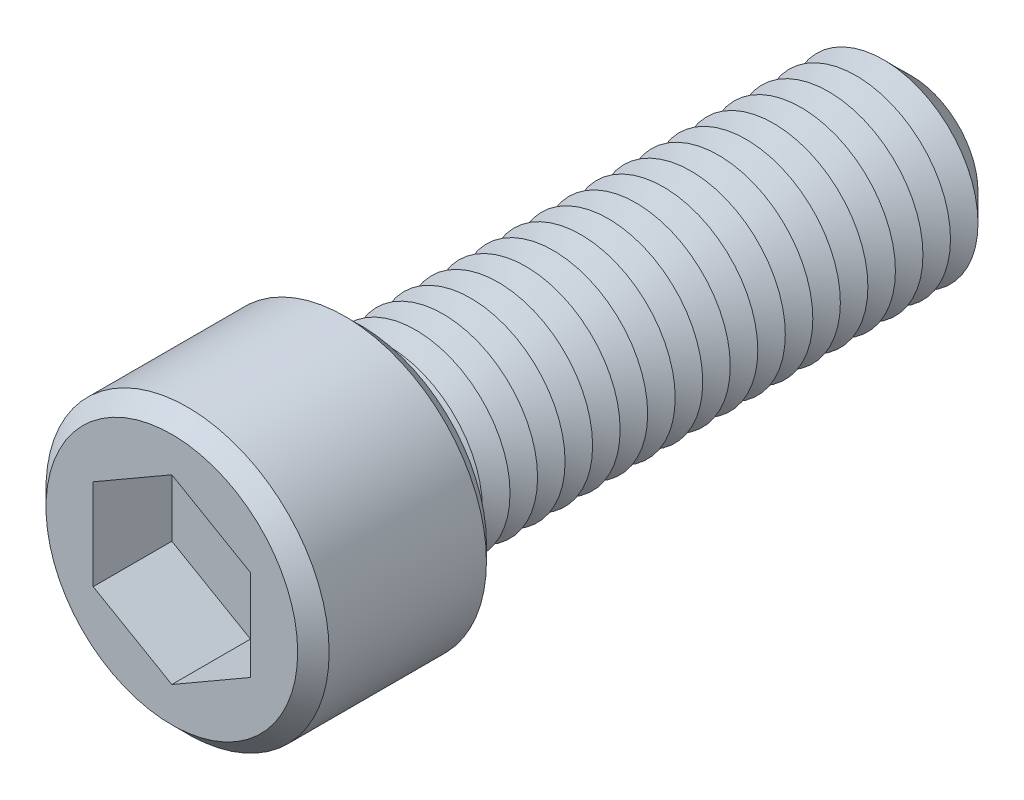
from build123d import *

# Parameters (mm, degrees)
SKETCH1_R           = 9
BOSS_EXTRUDE1_DEPTH = 12
SKETCH2_R           = 6
BOSS_EXTRUDE2_DEPTH = 35
CHAMFER1_SIZE       = 1.75
LPATTERN1_COUNT     = 19
LPATTERN1_PITCH     = 1.75
CUT_EXTRUDE1_DEPTH  = 5
SKETCH6_R           = 0.9
CUT_EXTRUDE2_DEPTH  = 42
CHAMFER2_SIZE       = 1


with BuildPart() as part:
    # Sketch1 → Boss-Extrude1 (new body)
    with BuildSketch(Plane.XY):
        Circle(SKETCH1_R)
    extrude(amount=BOSS_EXTRUDE1_DEPTH)

    # Sketch2 → Boss-Extrude2 (add)
    with BuildSketch(Plane(origin=(0, 0, 0), x_dir=(-1, 0, 0), z_dir=(0, 0, -1))):
        Circle(SKETCH2_R)
    extrude(amount=BOSS_EXTRUDE2_DEPTH)

    # Chamfer1
    chamfer1_edges = [part.edges().sort_by_distance(p)[0] for p in [
        (6, 0, -35),
    ]]
    chamfer(chamfer1_edges, length=CHAMFER1_SIZE)

    # Sketch4 → Cut-Revolve1 (revolve, cut)
    with BuildSketch(Plane(origin=(0, 0, 0), x_dir=(0, 0, -1), z_dir=(1, 0, 0)), mode=Mode.PRIVATE) as cut_revolve1_sk:
        Polygon((0, 6), (0.875, 4.484455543), (1.75, 6), align=None)
    cut_revolve1 = revolve(cut_revolve1_sk.sketch.rotate(Axis((0, 0, 2.512122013), (0, 0, -1)), 90), axis=Axis((0, 0, 2.512122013), (0, 0, -1)), mode=Mode.SUBTRACT)

    # LPattern1: Cut-Revolve1 ×19
    with Locations(*[(0, 0, -i * LPATTERN1_PITCH) for i in range(1, LPATTERN1_COUNT)]):
        add(cut_revolve1, mode=Mode.SUBTRACT)

    # Sketch5 → Cut-Extrude1 (cut)
    with BuildSketch(Plane.XY.offset(12)):
        Polygon((0, 5.773502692), (-5, 2.886751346), (-5, -2.886751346), (0, -5.773502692), (5, -2.886751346), (5, 2.886751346), align=None)
    extrude(amount=-CUT_EXTRUDE1_DEPTH, mode=Mode.SUBTRACT)

    # Sketch6 → Cut-Extrude2 (cut)
    with BuildSketch(Plane.XY.offset(7)):
        Circle(SKETCH6_R)
    extrude(amount=-CUT_EXTRUDE2_DEPTH, mode=Mode.SUBTRACT)

    # Chamfer2
    chamfer2_edges = [part.edges().sort_by_distance(p)[0] for p in [
        (-9, 0, 0),
        (-9, 0, 12),
    ]]
    chamfer(chamfer2_edges, length=CHAMFER2_SIZE)


solid = part.part
